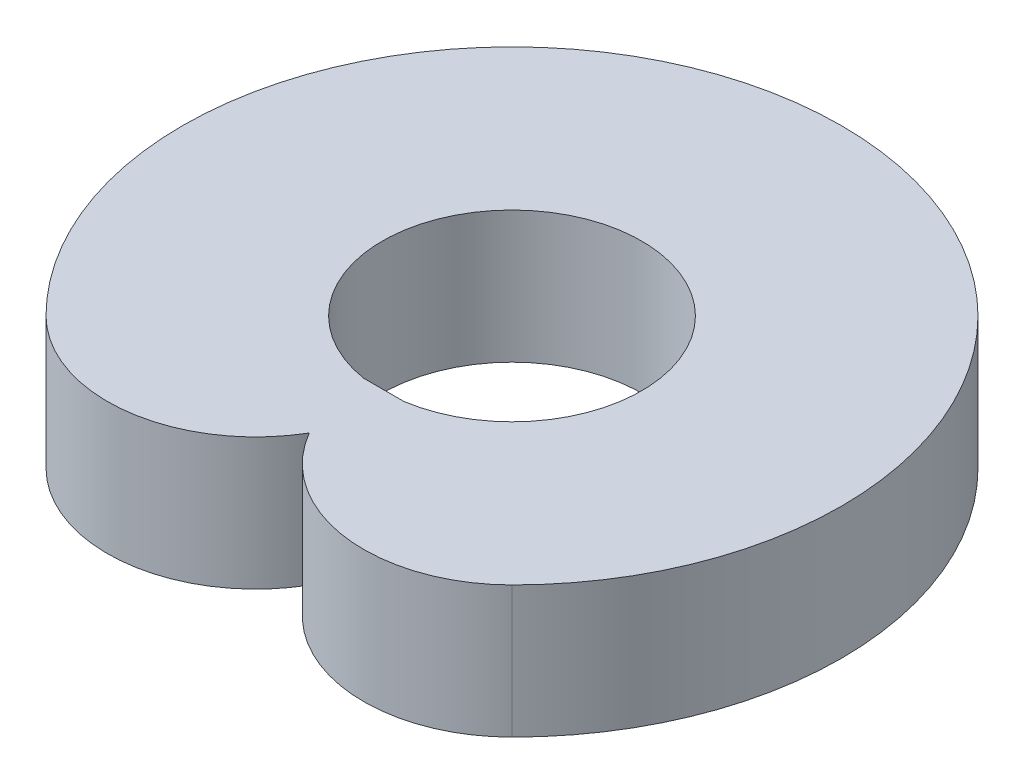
ISO-10303-21;
HEADER;
FILE_DESCRIPTION(('STEP AP214'),'2;1');
FILE_NAME('part.step','',(''),(''),'','','');
FILE_SCHEMA(('AUTOMOTIVE_DESIGN { 1 0 10303 214 1 1 1 1 }'));
ENDSEC;
DATA;
#1=APPLICATION_CONTEXT('core data for automotive mechanical design processes');
#2=APPLICATION_PROTOCOL_DEFINITION('international standard','automotive_design',2000,#1);
#3=PRODUCT_CONTEXT('',#1,'mechanical');
#4=PRODUCT('Part','Part','',(#3));
#5=PRODUCT_RELATED_PRODUCT_CATEGORY('part','',(#4));
#6=PRODUCT_DEFINITION_FORMATION('','',#4);
#7=PRODUCT_DEFINITION_CONTEXT('part definition',#1,'design');
#8=PRODUCT_DEFINITION('design','',#6,#7);
#9=PRODUCT_DEFINITION_SHAPE('','',#8);
#10=(LENGTH_UNIT() NAMED_UNIT(*) SI_UNIT(.MILLI.,.METRE.));
#11=(NAMED_UNIT(*) PLANE_ANGLE_UNIT() SI_UNIT($,.RADIAN.));
#12=(NAMED_UNIT(*) SI_UNIT($,.STERADIAN.) SOLID_ANGLE_UNIT());
#13=UNCERTAINTY_MEASURE_WITH_UNIT(LENGTH_MEASURE(1.E-05),#10,'distance_accuracy_value','');
#14=(GEOMETRIC_REPRESENTATION_CONTEXT(3) GLOBAL_UNCERTAINTY_ASSIGNED_CONTEXT((#13)) GLOBAL_UNIT_ASSIGNED_CONTEXT((#10,
#11,#12)) REPRESENTATION_CONTEXT('',''));
#15=CARTESIAN_POINT('',(0.,0.,0.));
#16=DIRECTION('',(0.,0.,1.));
#17=DIRECTION('',(1.,0.,0.));
#18=AXIS2_PLACEMENT_3D('',#15,#16,#17);
#19=CARTESIAN_POINT('',(194.4543648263,400.,194.454364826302));
#20=DIRECTION('',(0.,1.,0.));
#21=DIRECTION('',(0.,0.,1.));
#22=AXIS2_PLACEMENT_3D('',#19,#20,#21);
#23=PLANE('',#22);
#24=CARTESIAN_POINT('',(388.908729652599,400.,388.908729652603));
#25=DIRECTION('',(0.,1.,0.));
#26=DIRECTION('',(0.,0.,1.));
#27=AXIS2_PLACEMENT_3D('',#24,#25,#26);
#28=CIRCLE('',#27,450.);
#29=CARTESIAN_POINT('',(2.22044604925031E-13,400.,615.293358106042));
#30=VERTEX_POINT('',#29);
#31=CARTESIAN_POINT('',(707.106781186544,400.,707.106781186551));
#32=VERTEX_POINT('',#31);
#33=EDGE_CURVE('E98',#30,#32,#28,.T.);
#34=ORIENTED_EDGE('',*,*,#33,.T.);
#35=CARTESIAN_POINT('',(0.,400.,0.));
#36=DIRECTION('',(0.,1.,0.));
#37=DIRECTION('',(0.,0.,1.));
#38=AXIS2_PLACEMENT_3D('',#35,#36,#37);
#39=CIRCLE('',#38,1000.);
#40=CARTESIAN_POINT('',(-707.106781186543,400.,707.106781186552));
#41=VERTEX_POINT('',#40);
#42=EDGE_CURVE('E101',#32,#41,#39,.T.);
#43=ORIENTED_EDGE('',*,*,#42,.T.);
#44=CARTESIAN_POINT('',(-388.908729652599,400.,388.908729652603));
#45=DIRECTION('',(0.,1.,0.));
#46=DIRECTION('',(0.,0.,1.));
#47=AXIS2_PLACEMENT_3D('',#44,#45,#46);
#48=CIRCLE('',#47,450.);
#49=EDGE_CURVE('E104',#41,#30,#48,.T.);
#50=ORIENTED_EDGE('',*,*,#49,.T.);
#51=EDGE_LOOP('',(#34,#43,#50));
#52=FACE_BOUND('',#51,.T.);
#53=DIRECTION('',(1.,0.,0.));
#54=VECTOR('',#53,1.);
#55=CARTESIAN_POINT('',(61.0912703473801,400.,388.908729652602));
#56=LINE('',#55,#54);
#57=CARTESIAN_POINT('',(-61.0912703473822,400.,388.908729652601));
#58=VERTEX_POINT('',#57);
#59=CARTESIAN_POINT('',(61.0912703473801,400.,388.908729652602));
#60=VERTEX_POINT('',#59);
#61=EDGE_CURVE('E81',#58,#60,#56,.T.);
#62=ORIENTED_EDGE('',*,*,#61,.F.);
#63=CARTESIAN_POINT('',(0.,400.,0.));
#64=DIRECTION('',(0.,1.,0.));
#65=DIRECTION('',(0.,0.,1.));
#66=AXIS2_PLACEMENT_3D('',#63,#64,#65);
#67=CIRCLE('',#66,393.677715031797);
#68=EDGE_CURVE('E87',#60,#58,#67,.T.);
#69=ORIENTED_EDGE('',*,*,#68,.F.);
#70=EDGE_LOOP('',(#62,#69));
#71=FACE_BOUND('',#70,.T.);
#72=ADVANCED_FACE('F35',(#52,#71),#23,.T.);
#73=CARTESIAN_POINT('',(194.4543648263,0.,194.454364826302));
#74=DIRECTION('',(0.,1.,0.));
#75=DIRECTION('',(0.,0.,1.));
#76=AXIS2_PLACEMENT_3D('',#73,#74,#75);
#77=PLANE('',#76);
#78=CARTESIAN_POINT('',(388.908729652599,0.,388.908729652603));
#79=DIRECTION('',(0.,1.,0.));
#80=DIRECTION('',(0.,0.,1.));
#81=AXIS2_PLACEMENT_3D('',#78,#79,#80);
#82=CIRCLE('',#81,450.);
#83=CARTESIAN_POINT('',(2.22044604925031E-13,0.,615.293358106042));
#84=VERTEX_POINT('',#83);
#85=CARTESIAN_POINT('',(707.106781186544,0.,707.106781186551));
#86=VERTEX_POINT('',#85);
#87=EDGE_CURVE('E97',#84,#86,#82,.T.);
#88=ORIENTED_EDGE('',*,*,#87,.F.);
#89=CARTESIAN_POINT('',(-388.908729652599,0.,388.908729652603));
#90=DIRECTION('',(0.,1.,0.));
#91=DIRECTION('',(0.,0.,1.));
#92=AXIS2_PLACEMENT_3D('',#89,#90,#91);
#93=CIRCLE('',#92,450.);
#94=CARTESIAN_POINT('',(-707.106781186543,0.,707.106781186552));
#95=VERTEX_POINT('',#94);
#96=EDGE_CURVE('E102',#95,#84,#93,.T.);
#97=ORIENTED_EDGE('',*,*,#96,.F.);
#98=CARTESIAN_POINT('',(0.,0.,0.));
#99=DIRECTION('',(0.,1.,0.));
#100=DIRECTION('',(0.,0.,1.));
#101=AXIS2_PLACEMENT_3D('',#98,#99,#100);
#102=CIRCLE('',#101,1000.);
#103=EDGE_CURVE('E109',#86,#95,#102,.T.);
#104=ORIENTED_EDGE('',*,*,#103,.F.);
#105=EDGE_LOOP('',(#88,#97,#104));
#106=FACE_BOUND('',#105,.T.);
#107=CARTESIAN_POINT('',(0.,0.,0.));
#108=DIRECTION('',(0.,1.,0.));
#109=DIRECTION('',(0.,0.,1.));
#110=AXIS2_PLACEMENT_3D('',#107,#108,#109);
#111=CIRCLE('',#110,393.677715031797);
#112=CARTESIAN_POINT('',(61.0912703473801,0.,388.908729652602));
#113=VERTEX_POINT('',#112);
#114=CARTESIAN_POINT('',(-61.0912703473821,0.,388.908729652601));
#115=VERTEX_POINT('',#114);
#116=EDGE_CURVE('E57',#113,#115,#111,.T.);
#117=ORIENTED_EDGE('',*,*,#116,.T.);
#118=DIRECTION('',(1.,0.,0.));
#119=VECTOR('',#118,1.);
#120=CARTESIAN_POINT('',(61.0912703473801,0.,388.908729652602));
#121=LINE('',#120,#119);
#122=EDGE_CURVE('E91',#115,#113,#121,.T.);
#123=ORIENTED_EDGE('',*,*,#122,.T.);
#124=EDGE_LOOP('',(#117,#123));
#125=FACE_BOUND('',#124,.T.);
#126=ADVANCED_FACE('F123',(#106,#125),#77,.F.);
#127=CARTESIAN_POINT('',(388.908729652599,400.,388.908729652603));
#128=DIRECTION('',(0.,-1.,0.));
#129=DIRECTION('',(0.,0.,-1.));
#130=AXIS2_PLACEMENT_3D('',#127,#128,#129);
#131=CYLINDRICAL_SURFACE('',#130,450.);
#132=ORIENTED_EDGE('',*,*,#87,.T.);
#133=DIRECTION('',(0.,-1.,0.));
#134=VECTOR('',#133,1.);
#135=CARTESIAN_POINT('',(707.106781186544,400.,707.106781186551));
#136=LINE('',#135,#134);
#137=EDGE_CURVE('E11',#32,#86,#136,.T.);
#138=ORIENTED_EDGE('',*,*,#137,.F.);
#139=ORIENTED_EDGE('',*,*,#33,.F.);
#140=DIRECTION('',(0.,-1.,0.));
#141=VECTOR('',#140,1.);
#142=CARTESIAN_POINT('',(2.22044604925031E-13,400.,615.293358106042));
#143=LINE('',#142,#141);
#144=EDGE_CURVE('E106',#30,#84,#143,.T.);
#145=ORIENTED_EDGE('',*,*,#144,.T.);
#146=EDGE_LOOP('',(#132,#138,#139,#145));
#147=FACE_BOUND('',#146,.T.);
#148=ADVANCED_FACE('F37',(#147),#131,.T.);
#149=CARTESIAN_POINT('',(0.,400.,0.));
#150=DIRECTION('',(0.,-1.,0.));
#151=DIRECTION('',(0.,0.,-1.));
#152=AXIS2_PLACEMENT_3D('',#149,#150,#151);
#153=CYLINDRICAL_SURFACE('',#152,1000.);
#154=ORIENTED_EDGE('',*,*,#103,.T.);
#155=DIRECTION('',(0.,-1.,0.));
#156=VECTOR('',#155,1.);
#157=CARTESIAN_POINT('',(-707.106781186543,400.,707.106781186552));
#158=LINE('',#157,#156);
#159=EDGE_CURVE('E43',#41,#95,#158,.T.);
#160=ORIENTED_EDGE('',*,*,#159,.F.);
#161=ORIENTED_EDGE('',*,*,#42,.F.);
#162=ORIENTED_EDGE('',*,*,#137,.T.);
#163=EDGE_LOOP('',(#154,#160,#161,#162));
#164=FACE_BOUND('',#163,.T.);
#165=ADVANCED_FACE('F129',(#164),#153,.T.);
#166=CARTESIAN_POINT('',(-388.908729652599,400.,388.908729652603));
#167=DIRECTION('',(0.,-1.,0.));
#168=DIRECTION('',(0.,0.,-1.));
#169=AXIS2_PLACEMENT_3D('',#166,#167,#168);
#170=CYLINDRICAL_SURFACE('',#169,450.);
#171=ORIENTED_EDGE('',*,*,#96,.T.);
#172=ORIENTED_EDGE('',*,*,#144,.F.);
#173=ORIENTED_EDGE('',*,*,#49,.F.);
#174=ORIENTED_EDGE('',*,*,#159,.T.);
#175=EDGE_LOOP('',(#171,#172,#173,#174));
#176=FACE_BOUND('',#175,.T.);
#177=ADVANCED_FACE('F118',(#176),#170,.T.);
#178=CARTESIAN_POINT('',(0.,400.,0.));
#179=DIRECTION('',(0.,-1.,0.));
#180=DIRECTION('',(0.,0.,-1.));
#181=AXIS2_PLACEMENT_3D('',#178,#179,#180);
#182=CYLINDRICAL_SURFACE('',#181,393.677715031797);
#183=ORIENTED_EDGE('',*,*,#116,.F.);
#184=DIRECTION('',(0.,-1.,0.));
#185=VECTOR('',#184,1.);
#186=CARTESIAN_POINT('',(61.0912703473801,400.,388.908729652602));
#187=LINE('',#186,#185);
#188=EDGE_CURVE('E83',#60,#113,#187,.T.);
#189=ORIENTED_EDGE('',*,*,#188,.F.);
#190=ORIENTED_EDGE('',*,*,#68,.T.);
#191=DIRECTION('',(0.,-1.,0.));
#192=VECTOR('',#191,1.);
#193=CARTESIAN_POINT('',(-61.0912703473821,400.,388.908729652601));
#194=LINE('',#193,#192);
#195=EDGE_CURVE('E50',#58,#115,#194,.T.);
#196=ORIENTED_EDGE('',*,*,#195,.T.);
#197=EDGE_LOOP('',(#183,#189,#190,#196));
#198=FACE_BOUND('',#197,.T.);
#199=ADVANCED_FACE('F89',(#198),#182,.F.);
#200=CARTESIAN_POINT('',(61.0912703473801,400.,388.908729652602));
#201=DIRECTION('',(0.,0.,-1.));
#202=DIRECTION('',(-1.,0.,0.));
#203=AXIS2_PLACEMENT_3D('',#200,#201,#202);
#204=PLANE('',#203);
#205=ORIENTED_EDGE('',*,*,#122,.F.);
#206=ORIENTED_EDGE('',*,*,#195,.F.);
#207=ORIENTED_EDGE('',*,*,#61,.T.);
#208=ORIENTED_EDGE('',*,*,#188,.T.);
#209=EDGE_LOOP('',(#205,#206,#207,#208));
#210=FACE_BOUND('',#209,.T.);
#211=ADVANCED_FACE('F82',(#210),#204,.T.);
#212=CLOSED_SHELL('',(#72,#126,#148,#165,#177,#199,#211));
#213=MANIFOLD_SOLID_BREP('B2',#212);
#214=ADVANCED_BREP_SHAPE_REPRESENTATION('',(#18,#213),#14);
#215=SHAPE_DEFINITION_REPRESENTATION(#9,#214);
ENDSEC;
END-ISO-10303-21;
